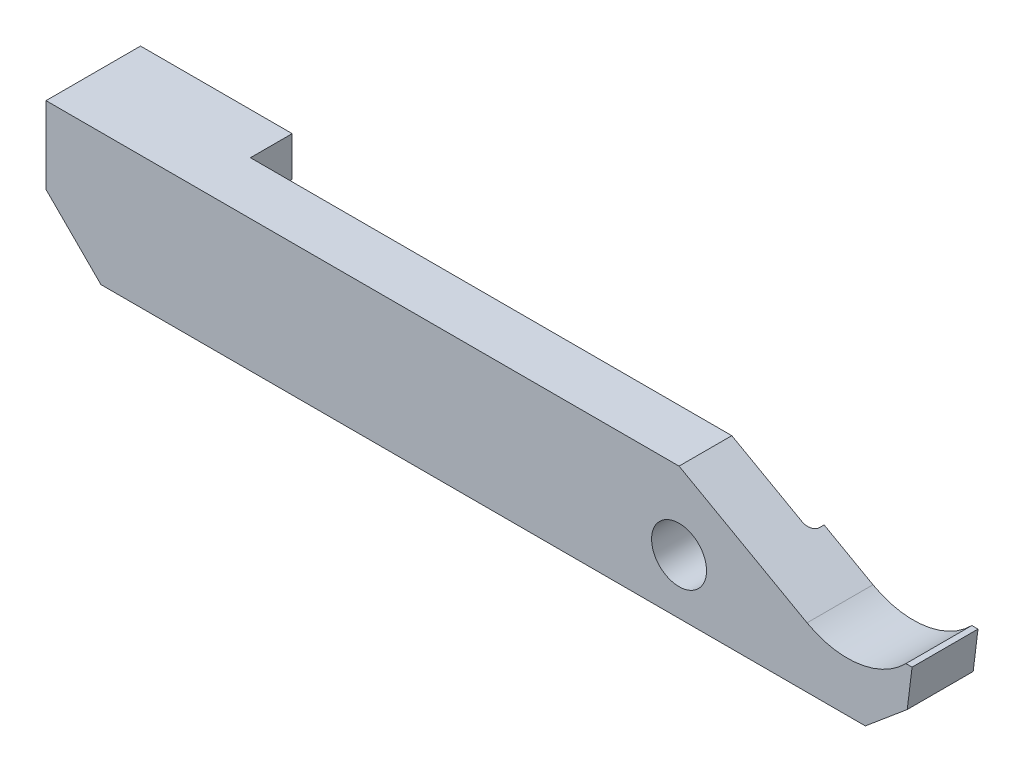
ISO-10303-21;
HEADER;
FILE_DESCRIPTION(('STEP AP214'),'2;1');
FILE_NAME('part.step','',(''),(''),'','','');
FILE_SCHEMA(('AUTOMOTIVE_DESIGN { 1 0 10303 214 1 1 1 1 }'));
ENDSEC;
DATA;
#1=APPLICATION_CONTEXT('core data for automotive mechanical design processes');
#2=APPLICATION_PROTOCOL_DEFINITION('international standard','automotive_design',2000,#1);
#3=PRODUCT_CONTEXT('',#1,'mechanical');
#4=PRODUCT('Part','Part','',(#3));
#5=PRODUCT_RELATED_PRODUCT_CATEGORY('part','',(#4));
#6=PRODUCT_DEFINITION_FORMATION('','',#4);
#7=PRODUCT_DEFINITION_CONTEXT('part definition',#1,'design');
#8=PRODUCT_DEFINITION('design','',#6,#7);
#9=PRODUCT_DEFINITION_SHAPE('','',#8);
#10=(LENGTH_UNIT() NAMED_UNIT(*) SI_UNIT(.MILLI.,.METRE.));
#11=(NAMED_UNIT(*) PLANE_ANGLE_UNIT() SI_UNIT($,.RADIAN.));
#12=(NAMED_UNIT(*) SI_UNIT($,.STERADIAN.) SOLID_ANGLE_UNIT());
#13=UNCERTAINTY_MEASURE_WITH_UNIT(LENGTH_MEASURE(1.E-05),#10,'distance_accuracy_value','');
#14=(GEOMETRIC_REPRESENTATION_CONTEXT(3) GLOBAL_UNCERTAINTY_ASSIGNED_CONTEXT((#13)) GLOBAL_UNIT_ASSIGNED_CONTEXT((#10,
#11,#12)) REPRESENTATION_CONTEXT('',''));
#15=CARTESIAN_POINT('',(0.,0.,0.));
#16=DIRECTION('',(0.,0.,1.));
#17=DIRECTION('',(1.,0.,0.));
#18=AXIS2_PLACEMENT_3D('',#15,#16,#17);
#19=CARTESIAN_POINT('',(46.2926258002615,7.62,-3.81));
#20=DIRECTION('',(0.,0.,1.));
#21=DIRECTION('',(1.,0.,0.));
#22=AXIS2_PLACEMENT_3D('',#19,#20,#21);
#23=CYLINDRICAL_SURFACE('',#22,4.7498);
#24=CARTESIAN_POINT('',(46.2926258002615,7.62,0.));
#25=DIRECTION('',(0.,0.,1.));
#26=DIRECTION('',(1.,0.,0.));
#27=AXIS2_PLACEMENT_3D('',#24,#25,#26);
#28=CIRCLE('',#27,4.7498);
#29=CARTESIAN_POINT('',(43.9707704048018,3.47637989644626,0.));
#30=VERTEX_POINT('',#29);
#31=CARTESIAN_POINT('',(49.6821699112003,4.2926,0.));
#32=VERTEX_POINT('',#31);
#33=EDGE_CURVE('E200',#30,#32,#28,.T.);
#34=ORIENTED_EDGE('',*,*,#33,.T.);
#35=DIRECTION('',(0.,0.,1.));
#36=VECTOR('',#35,1.);
#37=CARTESIAN_POINT('',(49.6821699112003,4.2926,-3.81));
#38=LINE('',#37,#36);
#39=CARTESIAN_POINT('',(49.6821699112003,4.2926,-3.81));
#40=VERTEX_POINT('',#39);
#41=EDGE_CURVE('E239',#40,#32,#38,.T.);
#42=ORIENTED_EDGE('',*,*,#41,.F.);
#43=CARTESIAN_POINT('',(46.2926258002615,7.62,-3.81));
#44=DIRECTION('',(0.,0.,1.));
#45=DIRECTION('',(1.,0.,0.));
#46=AXIS2_PLACEMENT_3D('',#43,#44,#45);
#47=CIRCLE('',#46,4.7498);
#48=CARTESIAN_POINT('',(43.9707704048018,3.47637989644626,-3.81));
#49=VERTEX_POINT('',#48);
#50=EDGE_CURVE('E201',#49,#40,#47,.T.);
#51=ORIENTED_EDGE('',*,*,#50,.F.);
#52=DIRECTION('',(0.,0.,1.));
#53=VECTOR('',#52,1.);
#54=CARTESIAN_POINT('',(43.9707704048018,3.47637989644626,-3.81));
#55=LINE('',#54,#53);
#56=EDGE_CURVE('E216',#49,#30,#55,.T.);
#57=ORIENTED_EDGE('',*,*,#56,.T.);
#58=EDGE_LOOP('',(#34,#42,#51,#57));
#59=FACE_BOUND('',#58,.T.);
#60=ADVANCED_FACE('F34',(#59),#23,.F.);
#61=CARTESIAN_POINT('',(0.,4.29260000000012,-3.81));
#62=DIRECTION('',(0.,-1.,0.));
#63=DIRECTION('',(1.,0.,0.));
#64=AXIS2_PLACEMENT_3D('',#61,#62,#63);
#65=PLANE('',#64);
#66=DIRECTION('',(1.,0.,0.));
#67=VECTOR('',#66,1.);
#68=CARTESIAN_POINT('',(0.,4.29260000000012,0.));
#69=LINE('',#68,#67);
#70=CARTESIAN_POINT('',(50.038,4.2926,0.));
#71=VERTEX_POINT('',#70);
#72=EDGE_CURVE('E235',#32,#71,#69,.T.);
#73=ORIENTED_EDGE('',*,*,#72,.T.);
#74=DIRECTION('',(0.,0.,1.));
#75=VECTOR('',#74,1.);
#76=CARTESIAN_POINT('',(50.038,4.2926,-3.81));
#77=LINE('',#76,#75);
#78=CARTESIAN_POINT('',(50.038,4.2926,-3.81));
#79=VERTEX_POINT('',#78);
#80=EDGE_CURVE('E243',#79,#71,#77,.T.);
#81=ORIENTED_EDGE('',*,*,#80,.F.);
#82=DIRECTION('',(1.,0.,0.));
#83=VECTOR('',#82,1.);
#84=CARTESIAN_POINT('',(0.,4.29260000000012,-3.81));
#85=LINE('',#84,#83);
#86=EDGE_CURVE('E214',#40,#79,#85,.T.);
#87=ORIENTED_EDGE('',*,*,#86,.F.);
#88=ORIENTED_EDGE('',*,*,#41,.T.);
#89=EDGE_LOOP('',(#73,#81,#87,#88));
#90=FACE_BOUND('',#89,.T.);
#91=ADVANCED_FACE('F300',(#90),#65,.F.);
#92=CARTESIAN_POINT('',(48.7755918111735,-5.98888962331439,-3.81));
#93=DIRECTION('',(-0.992546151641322,0.12186934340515,0.));
#94=DIRECTION('',(-0.12186934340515,-0.992546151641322,0.));
#95=AXIS2_PLACEMENT_3D('',#92,#93,#94);
#96=PLANE('',#95);
#97=DIRECTION('',(-0.12186934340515,-0.992546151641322,0.));
#98=VECTOR('',#97,1.);
#99=CARTESIAN_POINT('',(48.7755918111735,-5.98888962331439,0.));
#100=LINE('',#99,#98);
#101=CARTESIAN_POINT('',(49.7604332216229,2.032,0.));
#102=VERTEX_POINT('',#101);
#103=EDGE_CURVE('E233',#71,#102,#100,.T.);
#104=ORIENTED_EDGE('',*,*,#103,.T.);
#105=DIRECTION('',(0.,0.,1.));
#106=VECTOR('',#105,1.);
#107=CARTESIAN_POINT('',(49.7604332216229,2.032,-3.81));
#108=LINE('',#107,#106);
#109=CARTESIAN_POINT('',(49.7604332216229,2.032,-3.81));
#110=VERTEX_POINT('',#109);
#111=EDGE_CURVE('E246',#110,#102,#108,.T.);
#112=ORIENTED_EDGE('',*,*,#111,.F.);
#113=DIRECTION('',(-0.12186934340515,-0.992546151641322,0.));
#114=VECTOR('',#113,1.);
#115=CARTESIAN_POINT('',(48.7755918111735,-5.98888962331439,-3.81));
#116=LINE('',#115,#114);
#117=EDGE_CURVE('E212',#79,#110,#116,.T.);
#118=ORIENTED_EDGE('',*,*,#117,.F.);
#119=ORIENTED_EDGE('',*,*,#80,.T.);
#120=EDGE_LOOP('',(#104,#112,#118,#119));
#121=FACE_BOUND('',#120,.T.);
#122=ADVANCED_FACE('F310',(#121),#96,.F.);
#123=CARTESIAN_POINT('',(19.5592476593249,-23.3098036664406,-3.81));
#124=DIRECTION('',(-0.642787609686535,0.766044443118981,0.));
#125=DIRECTION('',(-0.766044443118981,-0.642787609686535,0.));
#126=AXIS2_PLACEMENT_3D('',#123,#124,#125);
#127=PLANE('',#126);
#128=DIRECTION('',(-0.766044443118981,-0.642787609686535,0.));
#129=VECTOR('',#128,1.);
#130=CARTESIAN_POINT('',(19.5592476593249,-23.3098036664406,0.));
#131=LINE('',#130,#129);
#132=CARTESIAN_POINT('',(47.3387899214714,0.,0.));
#133=VERTEX_POINT('',#132);
#134=EDGE_CURVE('E230',#102,#133,#131,.T.);
#135=ORIENTED_EDGE('',*,*,#134,.T.);
#136=DIRECTION('',(0.,0.,1.));
#137=VECTOR('',#136,1.);
#138=CARTESIAN_POINT('',(47.3387899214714,0.,-3.81));
#139=LINE('',#138,#137);
#140=CARTESIAN_POINT('',(47.3387899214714,0.,-3.81));
#141=VERTEX_POINT('',#140);
#142=EDGE_CURVE('E249',#141,#133,#139,.T.);
#143=ORIENTED_EDGE('',*,*,#142,.F.);
#144=DIRECTION('',(-0.766044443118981,-0.642787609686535,0.));
#145=VECTOR('',#144,1.);
#146=CARTESIAN_POINT('',(19.5592476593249,-23.3098036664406,-3.81));
#147=LINE('',#146,#145);
#148=EDGE_CURVE('E209',#110,#141,#147,.T.);
#149=ORIENTED_EDGE('',*,*,#148,.F.);
#150=ORIENTED_EDGE('',*,*,#111,.T.);
#151=EDGE_LOOP('',(#135,#143,#149,#150));
#152=FACE_BOUND('',#151,.T.);
#153=ADVANCED_FACE('F307',(#152),#127,.F.);
#154=CARTESIAN_POINT('',(0.,0.,-3.81));
#155=DIRECTION('',(0.,-1.,0.));
#156=DIRECTION('',(0.,0.,-1.));
#157=AXIS2_PLACEMENT_3D('',#154,#155,#156);
#158=PLANE('',#157);
#159=DIRECTION('',(0.,0.,-1.));
#160=VECTOR('',#159,1.);
#161=CARTESIAN_POINT('',(41.148,0.,-3.556));
#162=LINE('',#161,#160);
#163=CARTESIAN_POINT('',(41.148,0.,-3.556));
#164=VERTEX_POINT('',#163);
#165=CARTESIAN_POINT('',(41.148,0.,-3.81));
#166=VERTEX_POINT('',#165);
#167=EDGE_CURVE('E179',#164,#166,#162,.T.);
#168=ORIENTED_EDGE('',*,*,#167,.T.);
#169=DIRECTION('',(1.,0.,0.));
#170=VECTOR('',#169,1.);
#171=CARTESIAN_POINT('',(0.,0.,-3.81));
#172=LINE('',#171,#170);
#173=EDGE_CURVE('E207',#166,#141,#172,.T.);
#174=ORIENTED_EDGE('',*,*,#173,.T.);
#175=ORIENTED_EDGE('',*,*,#142,.T.);
#176=DIRECTION('',(1.,0.,0.));
#177=VECTOR('',#176,1.);
#178=CARTESIAN_POINT('',(0.,0.,0.));
#179=LINE('',#178,#177);
#180=CARTESIAN_POINT('',(3.175,0.,0.));
#181=VERTEX_POINT('',#180);
#182=EDGE_CURVE('E227',#181,#133,#179,.T.);
#183=ORIENTED_EDGE('',*,*,#182,.F.);
#184=DIRECTION('',(0.,0.,1.));
#185=VECTOR('',#184,1.);
#186=CARTESIAN_POINT('',(3.175,0.,-3.81));
#187=LINE('',#186,#185);
#188=CARTESIAN_POINT('',(3.175,0.,-3.048));
#189=VERTEX_POINT('',#188);
#190=EDGE_CURVE('E251',#189,#181,#187,.T.);
#191=ORIENTED_EDGE('',*,*,#190,.F.);
#192=DIRECTION('',(1.,0.,0.));
#193=VECTOR('',#192,1.);
#194=CARTESIAN_POINT('',(0.,0.,-3.048));
#195=LINE('',#194,#193);
#196=CARTESIAN_POINT('',(40.64,0.,-3.048));
#197=VERTEX_POINT('',#196);
#198=EDGE_CURVE('E173',#189,#197,#195,.T.);
#199=ORIENTED_EDGE('',*,*,#198,.T.);
#200=CARTESIAN_POINT('',(40.64,0.,-3.556));
#201=DIRECTION('',(0.,1.,0.));
#202=DIRECTION('',(0.,0.,1.));
#203=AXIS2_PLACEMENT_3D('',#200,#201,#202);
#204=CIRCLE('',#203,0.508000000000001);
#205=EDGE_CURVE('E176',#197,#164,#204,.T.);
#206=ORIENTED_EDGE('',*,*,#205,.T.);
#207=EDGE_LOOP('',(#168,#174,#175,#183,#191,#199,#206));
#208=FACE_BOUND('',#207,.T.);
#209=ADVANCED_FACE('F276',(#208),#158,.T.);
#210=CARTESIAN_POINT('',(1.5875,1.5875,-3.81));
#211=DIRECTION('',(-0.707106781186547,-0.707106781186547,0.));
#212=DIRECTION('',(0.707106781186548,-0.707106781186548,0.));
#213=AXIS2_PLACEMENT_3D('',#210,#211,#212);
#214=PLANE('',#213);
#215=DIRECTION('',(-0.707106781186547,0.707106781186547,0.));
#216=VECTOR('',#215,1.);
#217=CARTESIAN_POINT('',(1.5875,1.5875,-3.048));
#218=LINE('',#217,#216);
#219=CARTESIAN_POINT('',(0.,3.175,-3.048));
#220=VERTEX_POINT('',#219);
#221=EDGE_CURVE('E198',#189,#220,#218,.T.);
#222=ORIENTED_EDGE('',*,*,#221,.F.);
#223=ORIENTED_EDGE('',*,*,#190,.T.);
#224=DIRECTION('',(0.707106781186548,-0.707106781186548,0.));
#225=VECTOR('',#224,1.);
#226=CARTESIAN_POINT('',(1.5875,1.5875,0.));
#227=LINE('',#226,#225);
#228=CARTESIAN_POINT('',(0.,3.175,0.));
#229=VERTEX_POINT('',#228);
#230=EDGE_CURVE('E224',#229,#181,#227,.T.);
#231=ORIENTED_EDGE('',*,*,#230,.F.);
#232=DIRECTION('',(0.,0.,1.));
#233=VECTOR('',#232,1.);
#234=CARTESIAN_POINT('',(0.,3.175,-3.81));
#235=LINE('',#234,#233);
#236=EDGE_CURVE('E145',#220,#229,#235,.T.);
#237=ORIENTED_EDGE('',*,*,#236,.F.);
#238=EDGE_LOOP('',(#222,#223,#231,#237));
#239=FACE_BOUND('',#238,.T.);
#240=ADVANCED_FACE('F285',(#239),#214,.T.);
#241=CARTESIAN_POINT('',(0.,0.,-3.81));
#242=DIRECTION('',(1.,0.,0.));
#243=DIRECTION('',(0.,0.,-1.));
#244=AXIS2_PLACEMENT_3D('',#241,#242,#243);
#245=PLANE('',#244);
#246=DIRECTION('',(0.,1.,0.));
#247=VECTOR('',#246,1.);
#248=CARTESIAN_POINT('',(0.,0.,0.));
#249=LINE('',#248,#247);
#250=CARTESIAN_POINT('',(0.,7.62,0.));
#251=VERTEX_POINT('',#250);
#252=EDGE_CURVE('E141',#229,#251,#249,.T.);
#253=ORIENTED_EDGE('',*,*,#252,.T.);
#254=DIRECTION('',(0.,0.,1.));
#255=VECTOR('',#254,1.);
#256=CARTESIAN_POINT('',(0.,7.62,-3.81));
#257=LINE('',#256,#255);
#258=CARTESIAN_POINT('',(0.,7.62,-5.461));
#259=VERTEX_POINT('',#258);
#260=EDGE_CURVE('E135',#259,#251,#257,.T.);
#261=ORIENTED_EDGE('',*,*,#260,.F.);
#262=DIRECTION('',(0.,-1.,0.));
#263=VECTOR('',#262,1.);
#264=CARTESIAN_POINT('',(0.,0.,-5.461));
#265=LINE('',#264,#263);
#266=CARTESIAN_POINT('',(0.,5.334,-5.461));
#267=VERTEX_POINT('',#266);
#268=EDGE_CURVE('E139',#259,#267,#265,.T.);
#269=ORIENTED_EDGE('',*,*,#268,.T.);
#270=DIRECTION('',(0.,0.,1.));
#271=VECTOR('',#270,1.);
#272=CARTESIAN_POINT('',(0.,5.334,-5.461));
#273=LINE('',#272,#271);
#274=CARTESIAN_POINT('',(0.,5.334,-3.048));
#275=VERTEX_POINT('',#274);
#276=EDGE_CURVE('E166',#267,#275,#273,.T.);
#277=ORIENTED_EDGE('',*,*,#276,.T.);
#278=DIRECTION('',(0.,1.,0.));
#279=VECTOR('',#278,1.);
#280=CARTESIAN_POINT('',(0.,0.,-3.048));
#281=LINE('',#280,#279);
#282=EDGE_CURVE('E182',#220,#275,#281,.T.);
#283=ORIENTED_EDGE('',*,*,#282,.F.);
#284=ORIENTED_EDGE('',*,*,#236,.T.);
#285=EDGE_LOOP('',(#253,#261,#269,#277,#283,#284));
#286=FACE_BOUND('',#285,.T.);
#287=ADVANCED_FACE('F137',(#286),#245,.F.);
#288=CARTESIAN_POINT('',(0.,7.62,-3.81));
#289=DIRECTION('',(0.,-1.,0.));
#290=DIRECTION('',(0.,0.,-1.));
#291=AXIS2_PLACEMENT_3D('',#288,#289,#290);
#292=PLANE('',#291);
#293=DIRECTION('',(1.,0.,0.));
#294=VECTOR('',#293,1.);
#295=CARTESIAN_POINT('',(0.,7.62,-3.048));
#296=LINE('',#295,#294);
#297=CARTESIAN_POINT('',(8.763,7.62,-3.048));
#298=VERTEX_POINT('',#297);
#299=CARTESIAN_POINT('',(36.576,7.62,-3.048));
#300=VERTEX_POINT('',#299);
#301=EDGE_CURVE('E168',#298,#300,#296,.T.);
#302=ORIENTED_EDGE('',*,*,#301,.F.);
#303=DIRECTION('',(0.,0.,1.));
#304=VECTOR('',#303,1.);
#305=CARTESIAN_POINT('',(8.763,7.62,-5.461));
#306=LINE('',#305,#304);
#307=CARTESIAN_POINT('',(8.763,7.62,-5.461));
#308=VERTEX_POINT('',#307);
#309=EDGE_CURVE('E160',#308,#298,#306,.T.);
#310=ORIENTED_EDGE('',*,*,#309,.F.);
#311=DIRECTION('',(-1.,0.,0.));
#312=VECTOR('',#311,1.);
#313=CARTESIAN_POINT('',(0.,7.62,-5.461));
#314=LINE('',#313,#312);
#315=EDGE_CURVE('E153',#308,#259,#314,.T.);
#316=ORIENTED_EDGE('',*,*,#315,.T.);
#317=ORIENTED_EDGE('',*,*,#260,.T.);
#318=DIRECTION('',(1.,0.,0.));
#319=VECTOR('',#318,1.);
#320=CARTESIAN_POINT('',(0.,7.62,0.));
#321=LINE('',#320,#319);
#322=CARTESIAN_POINT('',(36.576,7.62,0.));
#323=VERTEX_POINT('',#322);
#324=EDGE_CURVE('E221',#251,#323,#321,.T.);
#325=ORIENTED_EDGE('',*,*,#324,.T.);
#326=DIRECTION('',(0.,0.,1.));
#327=VECTOR('',#326,1.);
#328=CARTESIAN_POINT('',(36.576,7.62,-3.81));
#329=LINE('',#328,#327);
#330=EDGE_CURVE('E146',#300,#323,#329,.T.);
#331=ORIENTED_EDGE('',*,*,#330,.F.);
#332=EDGE_LOOP('',(#302,#310,#316,#317,#325,#331));
#333=FACE_BOUND('',#332,.T.);
#334=ADVANCED_FACE('F158',(#333),#292,.F.);
#335=CARTESIAN_POINT('',(11.9896114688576,21.3968515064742,-3.81));
#336=DIRECTION('',(-0.48883224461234,-0.872377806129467,0.));
#337=DIRECTION('',(0.872377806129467,-0.48883224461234,0.));
#338=AXIS2_PLACEMENT_3D('',#335,#336,#337);
#339=PLANE('',#338);
#340=DIRECTION('',(0.872377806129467,-0.48883224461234,0.));
#341=VECTOR('',#340,1.);
#342=CARTESIAN_POINT('',(11.9896114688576,21.3968515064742,-3.81));
#343=LINE('',#342,#341);
#344=CARTESIAN_POINT('',(41.148,5.05810421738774,-3.81));
#345=VERTEX_POINT('',#344);
#346=EDGE_CURVE('E204',#345,#49,#343,.T.);
#347=ORIENTED_EDGE('',*,*,#346,.F.);
#348=DIRECTION('',(0.,0.,1.));
#349=VECTOR('',#348,1.);
#350=CARTESIAN_POINT('',(41.148,5.05810421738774,-3.81));
#351=LINE('',#350,#349);
#352=CARTESIAN_POINT('',(41.148,5.05810421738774,-3.556));
#353=VERTEX_POINT('',#352);
#354=EDGE_CURVE('E187',#345,#353,#351,.T.);
#355=ORIENTED_EDGE('',*,*,#354,.T.);
#356=CARTESIAN_POINT('',(40.64,5.34275930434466,-3.556));
#357=DIRECTION('',(-0.48883224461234,-0.872377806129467,0.));
#358=DIRECTION('',(-0.872377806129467,0.48883224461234,0.));
#359=AXIS2_PLACEMENT_3D('',#356,#357,#358);
#360=ELLIPSE('',#359,0.582316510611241,0.508000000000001);
#361=CARTESIAN_POINT('',(40.64,5.34275930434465,-3.048));
#362=VERTEX_POINT('',#361);
#363=EDGE_CURVE('E260',#353,#362,#360,.T.);
#364=ORIENTED_EDGE('',*,*,#363,.T.);
#365=DIRECTION('',(-0.872377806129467,0.48883224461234,0.));
#366=VECTOR('',#365,1.);
#367=CARTESIAN_POINT('',(11.9896114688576,21.3968515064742,-3.048));
#368=LINE('',#367,#366);
#369=EDGE_CURVE('E195',#362,#300,#368,.T.);
#370=ORIENTED_EDGE('',*,*,#369,.T.);
#371=ORIENTED_EDGE('',*,*,#330,.T.);
#372=DIRECTION('',(0.872377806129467,-0.48883224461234,0.));
#373=VECTOR('',#372,1.);
#374=CARTESIAN_POINT('',(11.9896114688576,21.3968515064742,0.));
#375=LINE('',#374,#373);
#376=EDGE_CURVE('E219',#323,#30,#375,.T.);
#377=ORIENTED_EDGE('',*,*,#376,.T.);
#378=ORIENTED_EDGE('',*,*,#56,.F.);
#379=EDGE_LOOP('',(#347,#355,#364,#370,#371,#377,#378));
#380=FACE_BOUND('',#379,.T.);
#381=ADVANCED_FACE('F266',(#380),#339,.F.);
#382=CARTESIAN_POINT('',(36.576,3.175,-3.81));
#383=DIRECTION('',(0.,0.,1.));
#384=DIRECTION('',(1.,0.,0.));
#385=AXIS2_PLACEMENT_3D('',#382,#383,#384);
#386=CYLINDRICAL_SURFACE('',#385,1.5875);
#387=CARTESIAN_POINT('',(36.576,3.175,-3.048));
#388=DIRECTION('',(0.,0.,1.));
#389=DIRECTION('',(1.,0.,0.));
#390=AXIS2_PLACEMENT_3D('',#387,#388,#389);
#391=CIRCLE('',#390,1.5875);
#392=CARTESIAN_POINT('',(38.1635,3.175,-3.048));
#393=VERTEX_POINT('',#392);
#394=EDGE_CURVE('E194',#393,#393,#391,.F.);
#395=CARTESIAN_POINT('',(36.576,3.175,0.));
#396=DIRECTION('',(0.,0.,1.));
#397=DIRECTION('',(1.,0.,0.));
#398=AXIS2_PLACEMENT_3D('',#395,#396,#397);
#399=CIRCLE('',#398,1.5875);
#400=CARTESIAN_POINT('',(38.1635,3.175,0.));
#401=VERTEX_POINT('',#400);
#402=EDGE_CURVE('E205',#401,#401,#399,.T.);
#403=CARTESIAN_POINT('',(38.1635,3.175,-3.048));
#404=CARTESIAN_POINT('',(38.1635,3.175,-3.01625));
#405=CARTESIAN_POINT('',(38.1635,3.175,-2.9845));
#406=CARTESIAN_POINT('',(38.1635,3.175,-2.921));
#407=CARTESIAN_POINT('',(38.1635,3.175,-2.88925));
#408=CARTESIAN_POINT('',(38.1635,3.175,-2.82575));
#409=CARTESIAN_POINT('',(38.1635,3.175,-2.794));
#410=CARTESIAN_POINT('',(38.1635,3.175,-2.7305));
#411=CARTESIAN_POINT('',(38.1635,3.175,-2.69875));
#412=CARTESIAN_POINT('',(38.1635,3.175,-2.63525));
#413=CARTESIAN_POINT('',(38.1635,3.175,-2.6035));
#414=CARTESIAN_POINT('',(38.1635,3.175,-2.54));
#415=CARTESIAN_POINT('',(38.1635,3.175,-2.50825));
#416=CARTESIAN_POINT('',(38.1635,3.175,-2.44475));
#417=CARTESIAN_POINT('',(38.1635,3.175,-2.413));
#418=CARTESIAN_POINT('',(38.1635,3.175,-2.3495));
#419=CARTESIAN_POINT('',(38.1635,3.175,-2.31775));
#420=CARTESIAN_POINT('',(38.1635,3.175,-2.25425));
#421=CARTESIAN_POINT('',(38.1635,3.175,-2.2225));
#422=CARTESIAN_POINT('',(38.1635,3.175,-2.159));
#423=CARTESIAN_POINT('',(38.1635,3.175,-2.12725));
#424=CARTESIAN_POINT('',(38.1635,3.175,-2.06375));
#425=CARTESIAN_POINT('',(38.1635,3.175,-2.032));
#426=CARTESIAN_POINT('',(38.1635,3.175,-1.9685));
#427=CARTESIAN_POINT('',(38.1635,3.175,-1.93675));
#428=CARTESIAN_POINT('',(38.1635,3.175,-1.87325));
#429=CARTESIAN_POINT('',(38.1635,3.175,-1.8415));
#430=CARTESIAN_POINT('',(38.1635,3.175,-1.778));
#431=CARTESIAN_POINT('',(38.1635,3.175,-1.74625));
#432=CARTESIAN_POINT('',(38.1635,3.175,-1.68275));
#433=CARTESIAN_POINT('',(38.1635,3.175,-1.651));
#434=CARTESIAN_POINT('',(38.1635,3.175,-1.5875));
#435=CARTESIAN_POINT('',(38.1635,3.175,-1.55575));
#436=CARTESIAN_POINT('',(38.1635,3.175,-1.49225));
#437=CARTESIAN_POINT('',(38.1635,3.175,-1.4605));
#438=CARTESIAN_POINT('',(38.1635,3.175,-1.397));
#439=CARTESIAN_POINT('',(38.1635,3.175,-1.36525));
#440=CARTESIAN_POINT('',(38.1635,3.175,-1.30175));
#441=CARTESIAN_POINT('',(38.1635,3.175,-1.27));
#442=CARTESIAN_POINT('',(38.1635,3.175,-1.2065));
#443=CARTESIAN_POINT('',(38.1635,3.175,-1.17475));
#444=CARTESIAN_POINT('',(38.1635,3.175,-1.11125));
#445=CARTESIAN_POINT('',(38.1635,3.175,-1.0795));
#446=CARTESIAN_POINT('',(38.1635,3.175,-1.016));
#447=CARTESIAN_POINT('',(38.1635,3.175,-0.98425));
#448=CARTESIAN_POINT('',(38.1635,3.175,-0.92075));
#449=CARTESIAN_POINT('',(38.1635,3.175,-0.889));
#450=CARTESIAN_POINT('',(38.1635,3.175,-0.8255));
#451=CARTESIAN_POINT('',(38.1635,3.175,-0.793750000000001));
#452=CARTESIAN_POINT('',(38.1635,3.175,-0.73025));
#453=CARTESIAN_POINT('',(38.1635,3.175,-0.6985));
#454=CARTESIAN_POINT('',(38.1635,3.175,-0.635));
#455=CARTESIAN_POINT('',(38.1635,3.175,-0.60325));
#456=CARTESIAN_POINT('',(38.1635,3.175,-0.53975));
#457=CARTESIAN_POINT('',(38.1635,3.175,-0.508));
#458=CARTESIAN_POINT('',(38.1635,3.175,-0.4445));
#459=CARTESIAN_POINT('',(38.1635,3.175,-0.41275));
#460=CARTESIAN_POINT('',(38.1635,3.175,-0.34925));
#461=CARTESIAN_POINT('',(38.1635,3.175,-0.3175));
#462=CARTESIAN_POINT('',(38.1635,3.175,-0.254));
#463=CARTESIAN_POINT('',(38.1635,3.175,-0.22225));
#464=CARTESIAN_POINT('',(38.1635,3.175,-0.15875));
#465=CARTESIAN_POINT('',(38.1635,3.175,-0.127));
#466=CARTESIAN_POINT('',(38.1635,3.175,-0.0634999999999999));
#467=CARTESIAN_POINT('',(38.1635,3.175,-0.03175));
#468=CARTESIAN_POINT('',(38.1635,3.175,0.));
#469=B_SPLINE_CURVE_WITH_KNOTS('',3,(#403,#404,#405,#406,#407,#408,#409,#410,#411,#412,#413,
#414,#415,#416,#417,#418,#419,#420,#421,#422,#423,#424,#425,#426,#427,#428,#429,#430,#431,#432,
#433,#434,#435,#436,#437,#438,#439,#440,#441,#442,#443,#444,#445,#446,#447,#448,#449,#450,#451,
#452,#453,#454,#455,#456,#457,#458,#459,#460,#461,#462,#463,#464,#465,#466,#467,#468),
.UNSPECIFIED.,.F.,.F.,(4,2,2,2,2,2,2,2,2,2,2,2,2,2,2,2,2,2,2,2,2,2,2,2,2,2,2,2,2,2,2,2,4),(0.,
0.0952500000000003,0.1905,0.28575,0.381,0.476250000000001,0.5715,0.66675,0.762,0.85725,
0.952500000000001,1.04775,1.143,1.23825,1.3335,1.42875,1.524,1.61925,1.7145,1.80975,1.905,
2.00025,2.0955,2.19075,2.286,2.38125,2.4765,2.57175,2.667,2.76225,2.8575,2.95275,3.048),.UNSPECIFIED.);
#470=EDGE_CURVE('BSEAM363',#393,#401,#469,.T.);
#471=ORIENTED_EDGE('',*,*,#394,.T.);
#472=ORIENTED_EDGE('',*,*,#402,.T.);
#473=ORIENTED_EDGE('',*,*,#470,.T.);
#474=ORIENTED_EDGE('',*,*,#470,.F.);
#475=EDGE_LOOP('',(#471,#473,#472,#474));
#476=FACE_BOUND('',#475,.T.);
#477=ADVANCED_FACE('F363',(#476),#386,.F.);
#478=CARTESIAN_POINT('',(0.,0.,-3.81));
#479=DIRECTION('',(0.,0.,1.));
#480=DIRECTION('',(1.,0.,0.));
#481=AXIS2_PLACEMENT_3D('',#478,#479,#480);
#482=PLANE('',#481);
#483=ORIENTED_EDGE('',*,*,#173,.F.);
#484=DIRECTION('',(0.,1.,0.));
#485=VECTOR('',#484,1.);
#486=CARTESIAN_POINT('',(41.148,0.,-3.81));
#487=LINE('',#486,#485);
#488=EDGE_CURVE('E242',#166,#345,#487,.T.);
#489=ORIENTED_EDGE('',*,*,#488,.T.);
#490=ORIENTED_EDGE('',*,*,#346,.T.);
#491=ORIENTED_EDGE('',*,*,#50,.T.);
#492=ORIENTED_EDGE('',*,*,#86,.T.);
#493=ORIENTED_EDGE('',*,*,#117,.T.);
#494=ORIENTED_EDGE('',*,*,#148,.T.);
#495=EDGE_LOOP('',(#483,#489,#490,#491,#492,#493,#494));
#496=FACE_BOUND('',#495,.T.);
#497=ADVANCED_FACE('F303',(#496),#482,.F.);
#498=CARTESIAN_POINT('',(0.,0.,0.));
#499=DIRECTION('',(0.,0.,1.));
#500=DIRECTION('',(1.,0.,0.));
#501=AXIS2_PLACEMENT_3D('',#498,#499,#500);
#502=PLANE('',#501);
#503=ORIENTED_EDGE('',*,*,#376,.F.);
#504=ORIENTED_EDGE('',*,*,#324,.F.);
#505=ORIENTED_EDGE('',*,*,#252,.F.);
#506=ORIENTED_EDGE('',*,*,#230,.T.);
#507=ORIENTED_EDGE('',*,*,#182,.T.);
#508=ORIENTED_EDGE('',*,*,#134,.F.);
#509=ORIENTED_EDGE('',*,*,#103,.F.);
#510=ORIENTED_EDGE('',*,*,#72,.F.);
#511=ORIENTED_EDGE('',*,*,#33,.F.);
#512=EDGE_LOOP('',(#503,#504,#505,#506,#507,#508,#509,#510,#511));
#513=FACE_BOUND('',#512,.T.);
#514=ORIENTED_EDGE('',*,*,#402,.F.);
#515=EDGE_LOOP('',(#514));
#516=FACE_BOUND('',#515,.T.);
#517=ADVANCED_FACE('F289',(#513,#516),#502,.T.);
#518=CARTESIAN_POINT('',(40.64,0.,-3.556));
#519=DIRECTION('',(0.,1.,0.));
#520=DIRECTION('',(0.,0.,1.));
#521=AXIS2_PLACEMENT_3D('',#518,#519,#520);
#522=CYLINDRICAL_SURFACE('',#521,0.508000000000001);
#523=DIRECTION('',(0.,1.,0.));
#524=VECTOR('',#523,1.);
#525=CARTESIAN_POINT('',(41.148,0.,-3.556));
#526=LINE('',#525,#524);
#527=EDGE_CURVE('E184',#164,#353,#526,.T.);
#528=ORIENTED_EDGE('',*,*,#527,.F.);
#529=ORIENTED_EDGE('',*,*,#205,.F.);
#530=DIRECTION('',(0.,1.,0.));
#531=VECTOR('',#530,1.);
#532=CARTESIAN_POINT('',(40.64,0.,-3.048));
#533=LINE('',#532,#531);
#534=EDGE_CURVE('E188',#197,#362,#533,.T.);
#535=ORIENTED_EDGE('',*,*,#534,.T.);
#536=ORIENTED_EDGE('',*,*,#363,.F.);
#537=EDGE_LOOP('',(#528,#529,#535,#536));
#538=FACE_BOUND('',#537,.T.);
#539=ADVANCED_FACE('F269',(#538),#522,.F.);
#540=CARTESIAN_POINT('',(0.,0.,-3.048));
#541=DIRECTION('',(0.,0.,1.));
#542=DIRECTION('',(1.,0.,0.));
#543=AXIS2_PLACEMENT_3D('',#540,#541,#542);
#544=PLANE('',#543);
#545=DIRECTION('',(1.,0.,0.));
#546=VECTOR('',#545,1.);
#547=CARTESIAN_POINT('',(0.,5.334,-3.048));
#548=LINE('',#547,#546);
#549=CARTESIAN_POINT('',(8.763,5.334,-3.048));
#550=VERTEX_POINT('',#549);
#551=EDGE_CURVE('E41',#275,#550,#548,.T.);
#552=ORIENTED_EDGE('',*,*,#551,.T.);
#553=DIRECTION('',(0.,1.,0.));
#554=VECTOR('',#553,1.);
#555=CARTESIAN_POINT('',(8.763,0.,-3.048));
#556=LINE('',#555,#554);
#557=EDGE_CURVE('E11',#550,#298,#556,.T.);
#558=ORIENTED_EDGE('',*,*,#557,.T.);
#559=ORIENTED_EDGE('',*,*,#301,.T.);
#560=ORIENTED_EDGE('',*,*,#369,.F.);
#561=ORIENTED_EDGE('',*,*,#534,.F.);
#562=ORIENTED_EDGE('',*,*,#198,.F.);
#563=ORIENTED_EDGE('',*,*,#221,.T.);
#564=ORIENTED_EDGE('',*,*,#282,.T.);
#565=EDGE_LOOP('',(#552,#558,#559,#560,#561,#562,#563,#564));
#566=FACE_BOUND('',#565,.T.);
#567=ORIENTED_EDGE('',*,*,#394,.F.);
#568=EDGE_LOOP('',(#567));
#569=FACE_BOUND('',#568,.T.);
#570=ADVANCED_FACE('F280',(#566,#569),#544,.F.);
#571=CARTESIAN_POINT('',(41.148,0.,-3.556));
#572=DIRECTION('',(1.,0.,0.));
#573=DIRECTION('',(0.,0.,-1.));
#574=AXIS2_PLACEMENT_3D('',#571,#572,#573);
#575=PLANE('',#574);
#576=ORIENTED_EDGE('',*,*,#488,.F.);
#577=ORIENTED_EDGE('',*,*,#167,.F.);
#578=ORIENTED_EDGE('',*,*,#527,.T.);
#579=ORIENTED_EDGE('',*,*,#354,.F.);
#580=EDGE_LOOP('',(#576,#577,#578,#579));
#581=FACE_BOUND('',#580,.T.);
#582=ADVANCED_FACE('F273',(#581),#575,.F.);
#583=CARTESIAN_POINT('',(8.763,0.,-5.461));
#584=DIRECTION('',(1.,0.,0.));
#585=DIRECTION('',(0.,0.,-1.));
#586=AXIS2_PLACEMENT_3D('',#583,#584,#585);
#587=PLANE('',#586);
#588=ORIENTED_EDGE('',*,*,#557,.F.);
#589=DIRECTION('',(0.,0.,1.));
#590=VECTOR('',#589,1.);
#591=CARTESIAN_POINT('',(8.763,5.334,-5.461));
#592=LINE('',#591,#590);
#593=CARTESIAN_POINT('',(8.763,5.334,-5.461));
#594=VERTEX_POINT('',#593);
#595=EDGE_CURVE('E169',#594,#550,#592,.T.);
#596=ORIENTED_EDGE('',*,*,#595,.F.);
#597=DIRECTION('',(0.,1.,0.));
#598=VECTOR('',#597,1.);
#599=CARTESIAN_POINT('',(8.763,0.,-5.461));
#600=LINE('',#599,#598);
#601=EDGE_CURVE('E164',#594,#308,#600,.T.);
#602=ORIENTED_EDGE('',*,*,#601,.T.);
#603=ORIENTED_EDGE('',*,*,#309,.T.);
#604=EDGE_LOOP('',(#588,#596,#602,#603));
#605=FACE_BOUND('',#604,.T.);
#606=ADVANCED_FACE('F402',(#605),#587,.T.);
#607=CARTESIAN_POINT('',(0.,5.334,-5.461));
#608=DIRECTION('',(0.,-1.,0.));
#609=DIRECTION('',(1.,0.,0.));
#610=AXIS2_PLACEMENT_3D('',#607,#608,#609);
#611=PLANE('',#610);
#612=ORIENTED_EDGE('',*,*,#551,.F.);
#613=ORIENTED_EDGE('',*,*,#276,.F.);
#614=DIRECTION('',(1.,0.,0.));
#615=VECTOR('',#614,1.);
#616=CARTESIAN_POINT('',(0.,5.334,-5.461));
#617=LINE('',#616,#615);
#618=EDGE_CURVE('E156',#267,#594,#617,.T.);
#619=ORIENTED_EDGE('',*,*,#618,.T.);
#620=ORIENTED_EDGE('',*,*,#595,.T.);
#621=EDGE_LOOP('',(#612,#613,#619,#620));
#622=FACE_BOUND('',#621,.T.);
#623=ADVANCED_FACE('F437',(#622),#611,.T.);
#624=CARTESIAN_POINT('',(0.,0.,-5.461));
#625=DIRECTION('',(0.,0.,1.));
#626=DIRECTION('',(1.,0.,0.));
#627=AXIS2_PLACEMENT_3D('',#624,#625,#626);
#628=PLANE('',#627);
#629=ORIENTED_EDGE('',*,*,#315,.F.);
#630=ORIENTED_EDGE('',*,*,#601,.F.);
#631=ORIENTED_EDGE('',*,*,#618,.F.);
#632=ORIENTED_EDGE('',*,*,#268,.F.);
#633=EDGE_LOOP('',(#629,#630,#631,#632));
#634=FACE_BOUND('',#633,.T.);
#635=ADVANCED_FACE('F151',(#634),#628,.F.);
#636=CLOSED_SHELL('',(#60,#91,#122,#153,#209,#240,#287,#334,#381,#477,#497,#517,#539,#570,#582,
#606,#623,#635));
#637=MANIFOLD_SOLID_BREP('B2',#636);
#638=ADVANCED_BREP_SHAPE_REPRESENTATION('',(#18,#637),#14);
#639=SHAPE_DEFINITION_REPRESENTATION(#9,#638);
ENDSEC;
END-ISO-10303-21;
